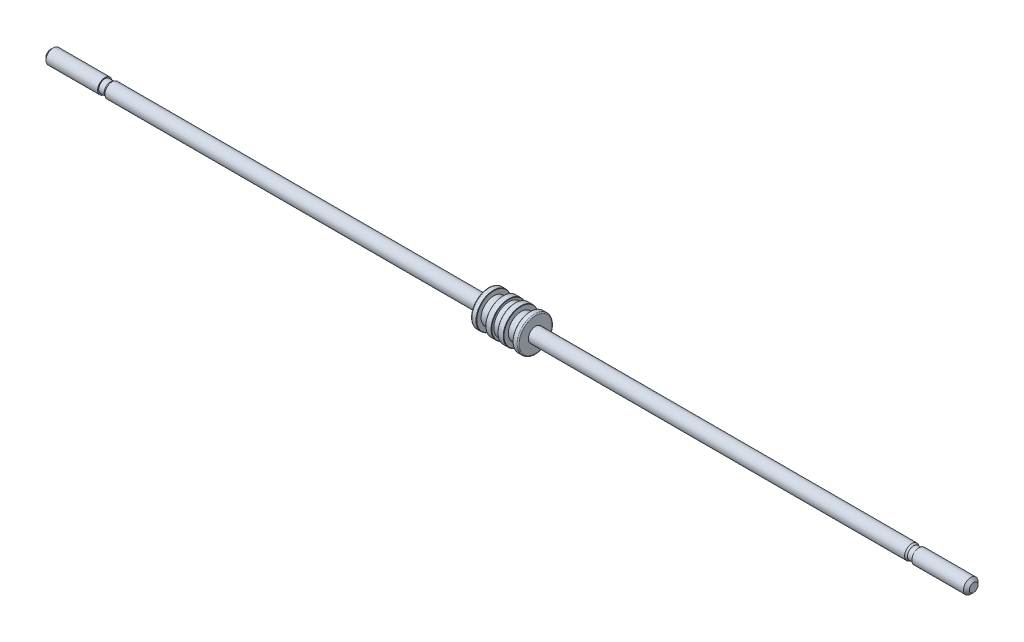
ISO-10303-21;
HEADER;
FILE_DESCRIPTION(('STEP AP214'),'2;1');
FILE_NAME('part.step','',(''),(''),'','','');
FILE_SCHEMA(('AUTOMOTIVE_DESIGN { 1 0 10303 214 1 1 1 1 }'));
ENDSEC;
DATA;
#1=APPLICATION_CONTEXT('core data for automotive mechanical design processes');
#2=APPLICATION_PROTOCOL_DEFINITION('international standard','automotive_design',2000,#1);
#3=PRODUCT_CONTEXT('',#1,'mechanical');
#4=PRODUCT('Part','Part','',(#3));
#5=PRODUCT_RELATED_PRODUCT_CATEGORY('part','',(#4));
#6=PRODUCT_DEFINITION_FORMATION('','',#4);
#7=PRODUCT_DEFINITION_CONTEXT('part definition',#1,'design');
#8=PRODUCT_DEFINITION('design','',#6,#7);
#9=PRODUCT_DEFINITION_SHAPE('','',#8);
#10=(LENGTH_UNIT() NAMED_UNIT(*) SI_UNIT(.MILLI.,.METRE.));
#11=(NAMED_UNIT(*) PLANE_ANGLE_UNIT() SI_UNIT($,.RADIAN.));
#12=(NAMED_UNIT(*) SI_UNIT($,.STERADIAN.) SOLID_ANGLE_UNIT());
#13=UNCERTAINTY_MEASURE_WITH_UNIT(LENGTH_MEASURE(1.E-05),#10,'distance_accuracy_value','');
#14=(GEOMETRIC_REPRESENTATION_CONTEXT(3) GLOBAL_UNCERTAINTY_ASSIGNED_CONTEXT((#13)) GLOBAL_UNIT_ASSIGNED_CONTEXT((#10,
#11,#12)) REPRESENTATION_CONTEXT('',''));
#15=CARTESIAN_POINT('',(0.,0.,0.));
#16=DIRECTION('',(0.,0.,1.));
#17=DIRECTION('',(1.,0.,0.));
#18=AXIS2_PLACEMENT_3D('',#15,#16,#17);
#19=CARTESIAN_POINT('',(0.,0.,0.));
#20=DIRECTION('',(1.,0.,0.));
#21=DIRECTION('',(0.,0.,-1.));
#22=AXIS2_PLACEMENT_3D('',#19,#20,#21);
#23=PLANE('',#22);
#24=CARTESIAN_POINT('',(0.,0.,0.));
#25=DIRECTION('',(1.,0.,0.));
#26=DIRECTION('',(0.,1.,0.));
#27=AXIS2_PLACEMENT_3D('',#24,#25,#26);
#28=CIRCLE('',#27,1.19999999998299);
#29=CARTESIAN_POINT('',(0.,1.19999999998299,0.));
#30=VERTEX_POINT('',#29);
#31=EDGE_CURVE('E240',#30,#30,#28,.T.);
#32=ORIENTED_EDGE('',*,*,#31,.F.);
#33=EDGE_LOOP('',(#32));
#34=FACE_BOUND('',#33,.T.);
#35=ADVANCED_FACE('F17',(#34),#23,.F.);
#36=CARTESIAN_POINT('',(0.799999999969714,0.,0.));
#37=DIRECTION('',(1.,0.,0.));
#38=DIRECTION('',(0.,1.,0.));
#39=AXIS2_PLACEMENT_3D('',#36,#37,#38);
#40=CONICAL_SURFACE('',#39,1.99999999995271,0.785398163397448);
#41=CARTESIAN_POINT('',(0.800000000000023,0.,0.));
#42=DIRECTION('',(-1.,0.,0.));
#43=DIRECTION('',(0.,0.,1.));
#44=AXIS2_PLACEMENT_3D('',#41,#42,#43);
#45=CIRCLE('',#44,2.);
#46=CARTESIAN_POINT('',(0.800000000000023,0.,2.));
#47=VERTEX_POINT('',#46);
#48=EDGE_CURVE('E239',#47,#47,#45,.F.);
#49=ORIENTED_EDGE('',*,*,#48,.F.);
#50=EDGE_LOOP('',(#49));
#51=FACE_BOUND('',#50,.T.);
#52=ORIENTED_EDGE('',*,*,#31,.T.);
#53=EDGE_LOOP('',(#52));
#54=FACE_BOUND('',#53,.T.);
#55=ADVANCED_FACE('F281',(#51,#54),#40,.T.);
#56=CARTESIAN_POINT('',(254.,0.,0.));
#57=DIRECTION('',(-1.,0.,0.));
#58=DIRECTION('',(0.,0.,1.));
#59=AXIS2_PLACEMENT_3D('',#56,#57,#58);
#60=CYLINDRICAL_SURFACE('',#59,2.);
#61=ORIENTED_EDGE('',*,*,#48,.T.);
#62=EDGE_LOOP('',(#61));
#63=FACE_BOUND('',#62,.T.);
#64=CARTESIAN_POINT('',(15.,0.,0.));
#65=DIRECTION('',(-1.,0.,0.));
#66=DIRECTION('',(0.,0.,1.));
#67=AXIS2_PLACEMENT_3D('',#64,#65,#66);
#68=CIRCLE('',#67,2.);
#69=CARTESIAN_POINT('',(15.,0.,2.));
#70=VERTEX_POINT('',#69);
#71=EDGE_CURVE('E236',#70,#70,#68,.T.);
#72=ORIENTED_EDGE('',*,*,#71,.T.);
#73=EDGE_LOOP('',(#72));
#74=FACE_BOUND('',#73,.T.);
#75=ADVANCED_FACE('F278',(#63,#74),#60,.T.);
#76=CARTESIAN_POINT('',(15.,2.,0.));
#77=DIRECTION('',(-1.,0.,0.));
#78=DIRECTION('',(0.,0.,1.));
#79=AXIS2_PLACEMENT_3D('',#76,#77,#78);
#80=PLANE('',#79);
#81=CARTESIAN_POINT('',(15.,0.,0.));
#82=DIRECTION('',(-1.,0.,0.));
#83=DIRECTION('',(0.,0.,1.));
#84=AXIS2_PLACEMENT_3D('',#81,#82,#83);
#85=CIRCLE('',#84,1.7);
#86=CARTESIAN_POINT('',(15.,0.,1.7));
#87=VERTEX_POINT('',#86);
#88=EDGE_CURVE('E232',#87,#87,#85,.F.);
#89=ORIENTED_EDGE('',*,*,#88,.F.);
#90=EDGE_LOOP('',(#89));
#91=FACE_BOUND('',#90,.T.);
#92=ORIENTED_EDGE('',*,*,#71,.F.);
#93=EDGE_LOOP('',(#92));
#94=FACE_BOUND('',#93,.T.);
#95=ADVANCED_FACE('F272',(#91,#94),#80,.F.);
#96=CARTESIAN_POINT('',(254.,0.,0.));
#97=DIRECTION('',(-1.,0.,0.));
#98=DIRECTION('',(0.,0.,1.));
#99=AXIS2_PLACEMENT_3D('',#96,#97,#98);
#100=CYLINDRICAL_SURFACE('',#99,1.7);
#101=ORIENTED_EDGE('',*,*,#88,.T.);
#102=EDGE_LOOP('',(#101));
#103=FACE_BOUND('',#102,.T.);
#104=CARTESIAN_POINT('',(16.4999999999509,0.,0.));
#105=DIRECTION('',(1.,0.,0.));
#106=DIRECTION('',(0.,0.,-1.));
#107=AXIS2_PLACEMENT_3D('',#104,#105,#106);
#108=CIRCLE('',#107,1.69999999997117);
#109=CARTESIAN_POINT('',(16.4999999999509,0.,-1.69999999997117));
#110=VERTEX_POINT('',#109);
#111=EDGE_CURVE('E235',#110,#110,#108,.T.);
#112=ORIENTED_EDGE('',*,*,#111,.F.);
#113=EDGE_LOOP('',(#112));
#114=FACE_BOUND('',#113,.T.);
#115=ADVANCED_FACE('F266',(#103,#114),#100,.T.);
#116=CARTESIAN_POINT('',(16.9999999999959,0.,0.));
#117=DIRECTION('',(1.,0.,0.));
#118=DIRECTION('',(0.,0.,-1.));
#119=AXIS2_PLACEMENT_3D('',#116,#117,#118);
#120=CONICAL_SURFACE('',#119,1.99999999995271,0.54041950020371);
#121=CARTESIAN_POINT('',(17.,0.,0.));
#122=DIRECTION('',(-1.,0.,0.));
#123=DIRECTION('',(0.,0.,1.));
#124=AXIS2_PLACEMENT_3D('',#121,#122,#123);
#125=CIRCLE('',#124,2.);
#126=CARTESIAN_POINT('',(17.,0.,2.));
#127=VERTEX_POINT('',#126);
#128=EDGE_CURVE('E68',#127,#127,#125,.F.);
#129=ORIENTED_EDGE('',*,*,#128,.F.);
#130=EDGE_LOOP('',(#129));
#131=FACE_BOUND('',#130,.T.);
#132=ORIENTED_EDGE('',*,*,#111,.T.);
#133=EDGE_LOOP('',(#132));
#134=FACE_BOUND('',#133,.T.);
#135=ADVANCED_FACE('F264',(#131,#134),#120,.T.);
#136=CARTESIAN_POINT('',(254.,0.,0.));
#137=DIRECTION('',(-1.,0.,0.));
#138=DIRECTION('',(0.,0.,1.));
#139=AXIS2_PLACEMENT_3D('',#136,#137,#138);
#140=CYLINDRICAL_SURFACE('',#139,2.);
#141=ORIENTED_EDGE('',*,*,#128,.T.);
#142=EDGE_LOOP('',(#141));
#143=FACE_BOUND('',#142,.T.);
#144=CARTESIAN_POINT('',(120.5,0.,0.));
#145=DIRECTION('',(-1.,0.,0.));
#146=DIRECTION('',(0.,0.,1.));
#147=AXIS2_PLACEMENT_3D('',#144,#145,#146);
#148=CIRCLE('',#147,2.);
#149=CARTESIAN_POINT('',(120.5,0.,2.));
#150=VERTEX_POINT('',#149);
#151=EDGE_CURVE('E53',#150,#150,#148,.T.);
#152=ORIENTED_EDGE('',*,*,#151,.T.);
#153=EDGE_LOOP('',(#152));
#154=FACE_BOUND('',#153,.T.);
#155=ADVANCED_FACE('F261',(#143,#154),#140,.T.);
#156=CARTESIAN_POINT('',(120.5,2.,0.));
#157=DIRECTION('',(1.,0.,0.));
#158=DIRECTION('',(0.,0.,-1.));
#159=AXIS2_PLACEMENT_3D('',#156,#157,#158);
#160=PLANE('',#159);
#161=CARTESIAN_POINT('',(120.5,0.,0.));
#162=DIRECTION('',(1.,0.,0.));
#163=DIRECTION('',(0.,0.,1.));
#164=AXIS2_PLACEMENT_3D('',#161,#162,#163);
#165=CIRCLE('',#164,4.5);
#166=CARTESIAN_POINT('',(120.5,0.,4.5));
#167=VERTEX_POINT('',#166);
#168=CARTESIAN_POINT('',(120.5,0.,-4.5));
#169=VERTEX_POINT('',#168);
#170=EDGE_CURVE('E45',#167,#169,#165,.T.);
#171=ORIENTED_EDGE('',*,*,#170,.F.);
#172=CARTESIAN_POINT('',(120.5,0.,0.));
#173=DIRECTION('',(1.,0.,0.));
#174=DIRECTION('',(0.,0.,-1.));
#175=AXIS2_PLACEMENT_3D('',#172,#173,#174);
#176=CIRCLE('',#175,4.5);
#177=EDGE_CURVE('E51',#169,#167,#176,.T.);
#178=ORIENTED_EDGE('',*,*,#177,.F.);
#179=EDGE_LOOP('',(#171,#178));
#180=FACE_BOUND('',#179,.T.);
#181=ORIENTED_EDGE('',*,*,#151,.F.);
#182=EDGE_LOOP('',(#181));
#183=FACE_BOUND('',#182,.T.);
#184=ADVANCED_FACE('F49',(#180,#183),#160,.F.);
#185=CARTESIAN_POINT('',(120.8,0.,0.));
#186=DIRECTION('',(-1.,0.,0.));
#187=DIRECTION('',(0.,0.,1.));
#188=AXIS2_PLACEMENT_3D('',#185,#186,#187);
#189=TOROIDAL_SURFACE('',#188,4.49999999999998,0.300000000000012);
#190=ORIENTED_EDGE('',*,*,#170,.T.);
#191=ORIENTED_EDGE('',*,*,#177,.T.);
#192=EDGE_LOOP('',(#190,#191));
#193=FACE_BOUND('',#192,.T.);
#194=CARTESIAN_POINT('',(120.8,0.,0.));
#195=DIRECTION('',(-1.,0.,0.));
#196=DIRECTION('',(0.,0.,1.));
#197=AXIS2_PLACEMENT_3D('',#194,#195,#196);
#198=CIRCLE('',#197,4.8);
#199=CARTESIAN_POINT('',(120.8,0.,4.8));
#200=VERTEX_POINT('',#199);
#201=EDGE_CURVE('E59',#200,#200,#198,.F.);
#202=ORIENTED_EDGE('',*,*,#201,.F.);
#203=EDGE_LOOP('',(#202));
#204=FACE_BOUND('',#203,.T.);
#205=ADVANCED_FACE('F57',(#193,#204),#189,.T.);
#206=CARTESIAN_POINT('',(254.,0.,0.));
#207=DIRECTION('',(-1.,0.,0.));
#208=DIRECTION('',(0.,0.,1.));
#209=AXIS2_PLACEMENT_3D('',#206,#207,#208);
#210=CYLINDRICAL_SURFACE('',#209,4.8);
#211=ORIENTED_EDGE('',*,*,#201,.T.);
#212=EDGE_LOOP('',(#211));
#213=FACE_BOUND('',#212,.T.);
#214=CARTESIAN_POINT('',(121.899999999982,0.,0.));
#215=DIRECTION('',(-1.,0.,0.));
#216=DIRECTION('',(0.,0.,1.));
#217=AXIS2_PLACEMENT_3D('',#214,#215,#216);
#218=CIRCLE('',#217,4.80000000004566);
#219=CARTESIAN_POINT('',(121.899999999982,0.,4.80000000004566));
#220=VERTEX_POINT('',#219);
#221=EDGE_CURVE('E87',#220,#220,#218,.F.);
#222=ORIENTED_EDGE('',*,*,#221,.F.);
#223=EDGE_LOOP('',(#222));
#224=FACE_BOUND('',#223,.T.);
#225=ADVANCED_FACE('F78',(#213,#224),#210,.T.);
#226=CARTESIAN_POINT('',(121.900000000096,0.,0.));
#227=DIRECTION('',(-1.,0.,0.));
#228=DIRECTION('',(0.,-1.,0.));
#229=AXIS2_PLACEMENT_3D('',#226,#227,#228);
#230=CONICAL_SURFACE('',#229,4.79999999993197,0.785398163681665);
#231=ORIENTED_EDGE('',*,*,#221,.T.);
#232=EDGE_LOOP('',(#231));
#233=FACE_BOUND('',#232,.T.);
#234=CARTESIAN_POINT('',(121.999999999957,0.,0.));
#235=DIRECTION('',(-1.,0.,0.));
#236=DIRECTION('',(0.,-1.,0.));
#237=AXIS2_PLACEMENT_3D('',#234,#235,#236);
#238=CIRCLE('',#237,4.70000000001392);
#239=CARTESIAN_POINT('',(121.999999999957,-4.70000000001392,0.));
#240=VERTEX_POINT('',#239);
#241=EDGE_CURVE('E90',#240,#240,#238,.T.);
#242=ORIENTED_EDGE('',*,*,#241,.T.);
#243=EDGE_LOOP('',(#242));
#244=FACE_BOUND('',#243,.T.);
#245=ADVANCED_FACE('F351',(#233,#244),#230,.T.);
#246=CARTESIAN_POINT('',(122.,4.7,0.));
#247=DIRECTION('',(-1.,0.,0.));
#248=DIRECTION('',(0.,0.,1.));
#249=AXIS2_PLACEMENT_3D('',#246,#247,#248);
#250=PLANE('',#249);
#251=CARTESIAN_POINT('',(122.,0.,0.));
#252=DIRECTION('',(-1.,0.,0.));
#253=DIRECTION('',(0.,0.,1.));
#254=AXIS2_PLACEMENT_3D('',#251,#252,#253);
#255=CIRCLE('',#254,3.5);
#256=CARTESIAN_POINT('',(122.,0.,3.5));
#257=VERTEX_POINT('',#256);
#258=EDGE_CURVE('E225',#257,#257,#255,.F.);
#259=ORIENTED_EDGE('',*,*,#258,.F.);
#260=EDGE_LOOP('',(#259));
#261=FACE_BOUND('',#260,.T.);
#262=ORIENTED_EDGE('',*,*,#241,.F.);
#263=EDGE_LOOP('',(#262));
#264=FACE_BOUND('',#263,.T.);
#265=ADVANCED_FACE('F360',(#261,#264),#250,.F.);
#266=CARTESIAN_POINT('',(254.,0.,0.));
#267=DIRECTION('',(-1.,0.,0.));
#268=DIRECTION('',(0.,0.,1.));
#269=AXIS2_PLACEMENT_3D('',#266,#267,#268);
#270=CYLINDRICAL_SURFACE('',#269,3.5);
#271=ORIENTED_EDGE('',*,*,#258,.T.);
#272=EDGE_LOOP('',(#271));
#273=FACE_BOUND('',#272,.T.);
#274=CARTESIAN_POINT('',(124.5,0.,0.));
#275=DIRECTION('',(-1.,0.,0.));
#276=DIRECTION('',(0.,0.,1.));
#277=AXIS2_PLACEMENT_3D('',#274,#275,#276);
#278=CIRCLE('',#277,3.5);
#279=CARTESIAN_POINT('',(124.5,0.,3.5));
#280=VERTEX_POINT('',#279);
#281=EDGE_CURVE('E222',#280,#280,#278,.T.);
#282=ORIENTED_EDGE('',*,*,#281,.T.);
#283=EDGE_LOOP('',(#282));
#284=FACE_BOUND('',#283,.T.);
#285=ADVANCED_FACE('F369',(#273,#284),#270,.T.);
#286=CARTESIAN_POINT('',(124.5,3.5,0.));
#287=DIRECTION('',(1.,0.,0.));
#288=DIRECTION('',(0.,0.,-1.));
#289=AXIS2_PLACEMENT_3D('',#286,#287,#288);
#290=PLANE('',#289);
#291=CARTESIAN_POINT('',(124.499999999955,0.,0.));
#292=DIRECTION('',(1.,0.,0.));
#293=DIRECTION('',(0.,0.,-1.));
#294=AXIS2_PLACEMENT_3D('',#291,#292,#293);
#295=CIRCLE('',#294,4.69999999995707);
#296=CARTESIAN_POINT('',(124.499999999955,0.,-4.69999999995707));
#297=VERTEX_POINT('',#296);
#298=EDGE_CURVE('E95',#297,#297,#295,.T.);
#299=ORIENTED_EDGE('',*,*,#298,.F.);
#300=EDGE_LOOP('',(#299));
#301=FACE_BOUND('',#300,.T.);
#302=ORIENTED_EDGE('',*,*,#281,.F.);
#303=EDGE_LOOP('',(#302));
#304=FACE_BOUND('',#303,.T.);
#305=ADVANCED_FACE('F379',(#301,#304),#290,.F.);
#306=CARTESIAN_POINT('',(124.599999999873,0.,0.));
#307=DIRECTION('',(1.,0.,0.));
#308=DIRECTION('',(0.,0.,-1.));
#309=AXIS2_PLACEMENT_3D('',#306,#307,#308);
#310=CONICAL_SURFACE('',#309,4.79999999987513,0.785398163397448);
#311=CARTESIAN_POINT('',(124.6,0.,0.));
#312=DIRECTION('',(-1.,0.,0.));
#313=DIRECTION('',(0.,0.,1.));
#314=AXIS2_PLACEMENT_3D('',#311,#312,#313);
#315=CIRCLE('',#314,4.8);
#316=CARTESIAN_POINT('',(124.6,0.,4.8));
#317=VERTEX_POINT('',#316);
#318=EDGE_CURVE('E91',#317,#317,#315,.F.);
#319=ORIENTED_EDGE('',*,*,#318,.F.);
#320=EDGE_LOOP('',(#319));
#321=FACE_BOUND('',#320,.T.);
#322=ORIENTED_EDGE('',*,*,#298,.T.);
#323=EDGE_LOOP('',(#322));
#324=FACE_BOUND('',#323,.T.);
#325=ADVANCED_FACE('F389',(#321,#324),#310,.T.);
#326=CARTESIAN_POINT('',(254.,0.,0.));
#327=DIRECTION('',(-1.,0.,0.));
#328=DIRECTION('',(0.,0.,1.));
#329=AXIS2_PLACEMENT_3D('',#326,#327,#328);
#330=CYLINDRICAL_SURFACE('',#329,4.8);
#331=ORIENTED_EDGE('',*,*,#318,.T.);
#332=EDGE_LOOP('',(#331));
#333=FACE_BOUND('',#332,.T.);
#334=CARTESIAN_POINT('',(126.049999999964,0.,0.));
#335=DIRECTION('',(-1.,0.,0.));
#336=DIRECTION('',(0.,0.,1.));
#337=AXIS2_PLACEMENT_3D('',#334,#335,#336);
#338=CIRCLE('',#337,4.80000000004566);
#339=CARTESIAN_POINT('',(126.049999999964,0.,4.80000000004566));
#340=VERTEX_POINT('',#339);
#341=EDGE_CURVE('E94',#340,#340,#338,.F.);
#342=ORIENTED_EDGE('',*,*,#341,.F.);
#343=EDGE_LOOP('',(#342));
#344=FACE_BOUND('',#343,.T.);
#345=ADVANCED_FACE('F399',(#333,#344),#330,.T.);
#346=CARTESIAN_POINT('',(126.050000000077,0.,0.));
#347=DIRECTION('',(-1.,0.,0.));
#348=DIRECTION('',(0.,0.,1.));
#349=AXIS2_PLACEMENT_3D('',#346,#347,#348);
#350=CONICAL_SURFACE('',#349,4.79999999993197,0.785398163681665);
#351=ORIENTED_EDGE('',*,*,#341,.T.);
#352=EDGE_LOOP('',(#351));
#353=FACE_BOUND('',#352,.T.);
#354=CARTESIAN_POINT('',(126.149999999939,0.,0.));
#355=DIRECTION('',(-1.,0.,0.));
#356=DIRECTION('',(0.,0.,1.));
#357=AXIS2_PLACEMENT_3D('',#354,#355,#356);
#358=CIRCLE('',#357,4.70000000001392);
#359=CARTESIAN_POINT('',(126.149999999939,0.,4.70000000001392));
#360=VERTEX_POINT('',#359);
#361=EDGE_CURVE('E98',#360,#360,#358,.T.);
#362=ORIENTED_EDGE('',*,*,#361,.T.);
#363=EDGE_LOOP('',(#362));
#364=FACE_BOUND('',#363,.T.);
#365=ADVANCED_FACE('F409',(#353,#364),#350,.T.);
#366=CARTESIAN_POINT('',(126.15,4.7,0.));
#367=DIRECTION('',(-1.,0.,0.));
#368=DIRECTION('',(0.,0.,1.));
#369=AXIS2_PLACEMENT_3D('',#366,#367,#368);
#370=PLANE('',#369);
#371=CARTESIAN_POINT('',(126.15,0.,0.));
#372=DIRECTION('',(-1.,0.,0.));
#373=DIRECTION('',(0.,0.,1.));
#374=AXIS2_PLACEMENT_3D('',#371,#372,#373);
#375=CIRCLE('',#374,4.15);
#376=CARTESIAN_POINT('',(126.15,0.,4.15));
#377=VERTEX_POINT('',#376);
#378=EDGE_CURVE('E215',#377,#377,#375,.F.);
#379=ORIENTED_EDGE('',*,*,#378,.F.);
#380=EDGE_LOOP('',(#379));
#381=FACE_BOUND('',#380,.T.);
#382=ORIENTED_EDGE('',*,*,#361,.F.);
#383=EDGE_LOOP('',(#382));
#384=FACE_BOUND('',#383,.T.);
#385=ADVANCED_FACE('F419',(#381,#384),#370,.F.);
#386=CARTESIAN_POINT('',(254.,0.,0.));
#387=DIRECTION('',(-1.,0.,0.));
#388=DIRECTION('',(0.,0.,1.));
#389=AXIS2_PLACEMENT_3D('',#386,#387,#388);
#390=CYLINDRICAL_SURFACE('',#389,4.15);
#391=ORIENTED_EDGE('',*,*,#378,.T.);
#392=EDGE_LOOP('',(#391));
#393=FACE_BOUND('',#392,.T.);
#394=CARTESIAN_POINT('',(127.85,0.,0.));
#395=DIRECTION('',(-1.,0.,0.));
#396=DIRECTION('',(0.,0.,1.));
#397=AXIS2_PLACEMENT_3D('',#394,#395,#396);
#398=CIRCLE('',#397,4.15);
#399=CARTESIAN_POINT('',(127.85,0.,4.15));
#400=VERTEX_POINT('',#399);
#401=EDGE_CURVE('E212',#400,#400,#398,.T.);
#402=ORIENTED_EDGE('',*,*,#401,.T.);
#403=EDGE_LOOP('',(#402));
#404=FACE_BOUND('',#403,.T.);
#405=ADVANCED_FACE('F429',(#393,#404),#390,.T.);
#406=CARTESIAN_POINT('',(127.85,4.15,0.));
#407=DIRECTION('',(1.,0.,0.));
#408=DIRECTION('',(0.,0.,-1.));
#409=AXIS2_PLACEMENT_3D('',#406,#407,#408);
#410=PLANE('',#409);
#411=CARTESIAN_POINT('',(127.849999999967,0.,0.));
#412=DIRECTION('',(1.,0.,0.));
#413=DIRECTION('',(0.,0.,-1.));
#414=AXIS2_PLACEMENT_3D('',#411,#412,#413);
#415=CIRCLE('',#414,4.69999999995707);
#416=CARTESIAN_POINT('',(127.849999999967,0.,-4.69999999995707));
#417=VERTEX_POINT('',#416);
#418=EDGE_CURVE('E103',#417,#417,#415,.T.);
#419=ORIENTED_EDGE('',*,*,#418,.F.);
#420=EDGE_LOOP('',(#419));
#421=FACE_BOUND('',#420,.T.);
#422=ORIENTED_EDGE('',*,*,#401,.F.);
#423=EDGE_LOOP('',(#422));
#424=FACE_BOUND('',#423,.T.);
#425=ADVANCED_FACE('F439',(#421,#424),#410,.F.);
#426=CARTESIAN_POINT('',(127.949999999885,0.,0.));
#427=DIRECTION('',(1.,0.,0.));
#428=DIRECTION('',(0.,0.,-1.));
#429=AXIS2_PLACEMENT_3D('',#426,#427,#428);
#430=CONICAL_SURFACE('',#429,4.79999999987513,0.785398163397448);
#431=CARTESIAN_POINT('',(127.95,0.,0.));
#432=DIRECTION('',(-1.,0.,0.));
#433=DIRECTION('',(0.,0.,1.));
#434=AXIS2_PLACEMENT_3D('',#431,#432,#433);
#435=CIRCLE('',#434,4.8);
#436=CARTESIAN_POINT('',(127.95,0.,4.8));
#437=VERTEX_POINT('',#436);
#438=EDGE_CURVE('E99',#437,#437,#435,.F.);
#439=ORIENTED_EDGE('',*,*,#438,.F.);
#440=EDGE_LOOP('',(#439));
#441=FACE_BOUND('',#440,.T.);
#442=ORIENTED_EDGE('',*,*,#418,.T.);
#443=EDGE_LOOP('',(#442));
#444=FACE_BOUND('',#443,.T.);
#445=ADVANCED_FACE('F449',(#441,#444),#430,.T.);
#446=CARTESIAN_POINT('',(254.,0.,0.));
#447=DIRECTION('',(-1.,0.,0.));
#448=DIRECTION('',(0.,0.,1.));
#449=AXIS2_PLACEMENT_3D('',#446,#447,#448);
#450=CYLINDRICAL_SURFACE('',#449,4.8);
#451=ORIENTED_EDGE('',*,*,#438,.T.);
#452=EDGE_LOOP('',(#451));
#453=FACE_BOUND('',#452,.T.);
#454=CARTESIAN_POINT('',(129.399999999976,0.,0.));
#455=DIRECTION('',(-1.,0.,0.));
#456=DIRECTION('',(0.,0.,1.));
#457=AXIS2_PLACEMENT_3D('',#454,#455,#456);
#458=CIRCLE('',#457,4.80000000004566);
#459=CARTESIAN_POINT('',(129.399999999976,0.,4.80000000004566));
#460=VERTEX_POINT('',#459);
#461=EDGE_CURVE('E102',#460,#460,#458,.F.);
#462=ORIENTED_EDGE('',*,*,#461,.F.);
#463=EDGE_LOOP('',(#462));
#464=FACE_BOUND('',#463,.T.);
#465=ADVANCED_FACE('F459',(#453,#464),#450,.T.);
#466=CARTESIAN_POINT('',(129.400000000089,0.,0.));
#467=DIRECTION('',(-1.,0.,0.));
#468=DIRECTION('',(0.,0.,1.));
#469=AXIS2_PLACEMENT_3D('',#466,#467,#468);
#470=CONICAL_SURFACE('',#469,4.79999999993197,0.785398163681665);
#471=ORIENTED_EDGE('',*,*,#461,.T.);
#472=EDGE_LOOP('',(#471));
#473=FACE_BOUND('',#472,.T.);
#474=CARTESIAN_POINT('',(129.49999999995,0.,0.));
#475=DIRECTION('',(-1.,0.,0.));
#476=DIRECTION('',(0.,0.,1.));
#477=AXIS2_PLACEMENT_3D('',#474,#475,#476);
#478=CIRCLE('',#477,4.70000000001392);
#479=CARTESIAN_POINT('',(129.49999999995,0.,4.70000000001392));
#480=VERTEX_POINT('',#479);
#481=EDGE_CURVE('E106',#480,#480,#478,.T.);
#482=ORIENTED_EDGE('',*,*,#481,.T.);
#483=EDGE_LOOP('',(#482));
#484=FACE_BOUND('',#483,.T.);
#485=ADVANCED_FACE('F469',(#473,#484),#470,.T.);
#486=CARTESIAN_POINT('',(129.5,4.7,0.));
#487=DIRECTION('',(-1.,0.,0.));
#488=DIRECTION('',(0.,0.,1.));
#489=AXIS2_PLACEMENT_3D('',#486,#487,#488);
#490=PLANE('',#489);
#491=CARTESIAN_POINT('',(129.5,0.,0.));
#492=DIRECTION('',(-1.,0.,0.));
#493=DIRECTION('',(0.,0.,1.));
#494=AXIS2_PLACEMENT_3D('',#491,#492,#493);
#495=CIRCLE('',#494,3.5);
#496=CARTESIAN_POINT('',(129.5,0.,3.5));
#497=VERTEX_POINT('',#496);
#498=EDGE_CURVE('E205',#497,#497,#495,.F.);
#499=ORIENTED_EDGE('',*,*,#498,.F.);
#500=EDGE_LOOP('',(#499));
#501=FACE_BOUND('',#500,.T.);
#502=ORIENTED_EDGE('',*,*,#481,.F.);
#503=EDGE_LOOP('',(#502));
#504=FACE_BOUND('',#503,.T.);
#505=ADVANCED_FACE('F479',(#501,#504),#490,.F.);
#506=CARTESIAN_POINT('',(254.,1.2,0.));
#507=DIRECTION('',(-1.,0.,0.));
#508=DIRECTION('',(0.,0.,1.));
#509=AXIS2_PLACEMENT_3D('',#506,#507,#508);
#510=PLANE('',#509);
#511=CARTESIAN_POINT('',(254.000000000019,0.,0.));
#512=DIRECTION('',(-1.,0.,0.));
#513=DIRECTION('',(0.,0.,1.));
#514=AXIS2_PLACEMENT_3D('',#511,#512,#513);
#515=CIRCLE('',#514,1.19999999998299);
#516=CARTESIAN_POINT('',(254.000000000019,0.,1.19999999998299));
#517=VERTEX_POINT('',#516);
#518=EDGE_CURVE('E202',#517,#517,#515,.T.);
#519=ORIENTED_EDGE('',*,*,#518,.F.);
#520=EDGE_LOOP('',(#519));
#521=FACE_BOUND('',#520,.T.);
#522=ADVANCED_FACE('F489',(#521),#510,.F.);
#523=CARTESIAN_POINT('',(254.,0.,0.));
#524=DIRECTION('',(-1.,0.,0.));
#525=DIRECTION('',(0.,0.,1.));
#526=AXIS2_PLACEMENT_3D('',#523,#524,#525);
#527=CYLINDRICAL_SURFACE('',#526,3.5);
#528=ORIENTED_EDGE('',*,*,#498,.T.);
#529=EDGE_LOOP('',(#528));
#530=FACE_BOUND('',#529,.T.);
#531=CARTESIAN_POINT('',(132.,0.,0.));
#532=DIRECTION('',(-1.,0.,0.));
#533=DIRECTION('',(0.,0.,1.));
#534=AXIS2_PLACEMENT_3D('',#531,#532,#533);
#535=CIRCLE('',#534,3.5);
#536=CARTESIAN_POINT('',(132.,0.,3.5));
#537=VERTEX_POINT('',#536);
#538=EDGE_CURVE('E111',#537,#537,#535,.T.);
#539=ORIENTED_EDGE('',*,*,#538,.T.);
#540=EDGE_LOOP('',(#539));
#541=FACE_BOUND('',#540,.T.);
#542=ADVANCED_FACE('F499',(#530,#541),#527,.T.);
#543=CARTESIAN_POINT('',(253.199999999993,0.,0.));
#544=DIRECTION('',(-1.,0.,0.));
#545=DIRECTION('',(0.,0.,1.));
#546=AXIS2_PLACEMENT_3D('',#543,#544,#545);
#547=CONICAL_SURFACE('',#546,2.00000000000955,0.785398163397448);
#548=CARTESIAN_POINT('',(253.2,0.,0.));
#549=DIRECTION('',(-1.,0.,0.));
#550=DIRECTION('',(0.,0.,1.));
#551=AXIS2_PLACEMENT_3D('',#548,#549,#550);
#552=CIRCLE('',#551,2.);
#553=CARTESIAN_POINT('',(253.2,0.,2.));
#554=VERTEX_POINT('',#553);
#555=EDGE_CURVE('E107',#554,#554,#552,.T.);
#556=ORIENTED_EDGE('',*,*,#555,.F.);
#557=EDGE_LOOP('',(#556));
#558=FACE_BOUND('',#557,.T.);
#559=ORIENTED_EDGE('',*,*,#518,.T.);
#560=EDGE_LOOP('',(#559));
#561=FACE_BOUND('',#560,.T.);
#562=ADVANCED_FACE('F509',(#558,#561),#547,.T.);
#563=CARTESIAN_POINT('',(132.,3.5,0.));
#564=DIRECTION('',(1.,0.,0.));
#565=DIRECTION('',(0.,0.,-1.));
#566=AXIS2_PLACEMENT_3D('',#563,#564,#565);
#567=PLANE('',#566);
#568=CARTESIAN_POINT('',(131.999999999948,0.,0.));
#569=DIRECTION('',(1.,0.,0.));
#570=DIRECTION('',(0.,0.,-1.));
#571=AXIS2_PLACEMENT_3D('',#568,#569,#570);
#572=CIRCLE('',#571,4.69999999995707);
#573=CARTESIAN_POINT('',(131.999999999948,0.,-4.69999999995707));
#574=VERTEX_POINT('',#573);
#575=EDGE_CURVE('E110',#574,#574,#572,.T.);
#576=ORIENTED_EDGE('',*,*,#575,.F.);
#577=EDGE_LOOP('',(#576));
#578=FACE_BOUND('',#577,.T.);
#579=ORIENTED_EDGE('',*,*,#538,.F.);
#580=EDGE_LOOP('',(#579));
#581=FACE_BOUND('',#580,.T.);
#582=ADVANCED_FACE('F519',(#578,#581),#567,.F.);
#583=CARTESIAN_POINT('',(254.,0.,0.));
#584=DIRECTION('',(-1.,0.,0.));
#585=DIRECTION('',(0.,0.,1.));
#586=AXIS2_PLACEMENT_3D('',#583,#584,#585);
#587=CYLINDRICAL_SURFACE('',#586,2.);
#588=CARTESIAN_POINT('',(239.,0.,0.));
#589=DIRECTION('',(-1.,0.,0.));
#590=DIRECTION('',(0.,0.,1.));
#591=AXIS2_PLACEMENT_3D('',#588,#589,#590);
#592=CIRCLE('',#591,2.);
#593=CARTESIAN_POINT('',(239.,0.,2.));
#594=VERTEX_POINT('',#593);
#595=EDGE_CURVE('E116',#594,#594,#592,.F.);
#596=ORIENTED_EDGE('',*,*,#595,.T.);
#597=EDGE_LOOP('',(#596));
#598=FACE_BOUND('',#597,.T.);
#599=ORIENTED_EDGE('',*,*,#555,.T.);
#600=EDGE_LOOP('',(#599));
#601=FACE_BOUND('',#600,.T.);
#602=ADVANCED_FACE('F529',(#598,#601),#587,.T.);
#603=CARTESIAN_POINT('',(132.099999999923,0.,0.));
#604=DIRECTION('',(1.,0.,0.));
#605=DIRECTION('',(0.,0.,-1.));
#606=AXIS2_PLACEMENT_3D('',#603,#604,#605);
#607=CONICAL_SURFACE('',#606,4.79999999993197,0.785398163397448);
#608=CARTESIAN_POINT('',(132.1,0.,0.));
#609=DIRECTION('',(-1.,0.,0.));
#610=DIRECTION('',(0.,0.,1.));
#611=AXIS2_PLACEMENT_3D('',#608,#609,#610);
#612=CIRCLE('',#611,4.8);
#613=CARTESIAN_POINT('',(132.1,0.,4.8));
#614=VERTEX_POINT('',#613);
#615=EDGE_CURVE('E112',#614,#614,#612,.F.);
#616=ORIENTED_EDGE('',*,*,#615,.F.);
#617=EDGE_LOOP('',(#616));
#618=FACE_BOUND('',#617,.T.);
#619=ORIENTED_EDGE('',*,*,#575,.T.);
#620=EDGE_LOOP('',(#619));
#621=FACE_BOUND('',#620,.T.);
#622=ADVANCED_FACE('F539',(#618,#621),#607,.T.);
#623=CARTESIAN_POINT('',(239.,1.7,0.));
#624=DIRECTION('',(1.,0.,0.));
#625=DIRECTION('',(0.,0.,-1.));
#626=AXIS2_PLACEMENT_3D('',#623,#624,#625);
#627=PLANE('',#626);
#628=ORIENTED_EDGE('',*,*,#595,.F.);
#629=EDGE_LOOP('',(#628));
#630=FACE_BOUND('',#629,.T.);
#631=CARTESIAN_POINT('',(239.,0.,0.));
#632=DIRECTION('',(-1.,0.,0.));
#633=DIRECTION('',(0.,0.,1.));
#634=AXIS2_PLACEMENT_3D('',#631,#632,#633);
#635=CIRCLE('',#634,1.7);
#636=CARTESIAN_POINT('',(239.,0.,1.7));
#637=VERTEX_POINT('',#636);
#638=EDGE_CURVE('E115',#637,#637,#635,.T.);
#639=ORIENTED_EDGE('',*,*,#638,.F.);
#640=EDGE_LOOP('',(#639));
#641=FACE_BOUND('',#640,.T.);
#642=ADVANCED_FACE('F549',(#630,#641),#627,.F.);
#643=CARTESIAN_POINT('',(254.,0.,0.));
#644=DIRECTION('',(-1.,0.,0.));
#645=DIRECTION('',(0.,0.,1.));
#646=AXIS2_PLACEMENT_3D('',#643,#644,#645);
#647=CYLINDRICAL_SURFACE('',#646,4.8);
#648=ORIENTED_EDGE('',*,*,#615,.T.);
#649=EDGE_LOOP('',(#648));
#650=FACE_BOUND('',#649,.T.);
#651=CARTESIAN_POINT('',(133.2,0.,0.));
#652=DIRECTION('',(-1.,0.,0.));
#653=DIRECTION('',(0.,0.,1.));
#654=AXIS2_PLACEMENT_3D('',#651,#652,#653);
#655=CIRCLE('',#654,4.8);
#656=CARTESIAN_POINT('',(133.2,0.,4.8));
#657=VERTEX_POINT('',#656);
#658=EDGE_CURVE('E117',#657,#657,#655,.F.);
#659=ORIENTED_EDGE('',*,*,#658,.F.);
#660=EDGE_LOOP('',(#659));
#661=FACE_BOUND('',#660,.T.);
#662=ADVANCED_FACE('F189',(#650,#661),#647,.T.);
#663=CARTESIAN_POINT('',(254.,0.,0.));
#664=DIRECTION('',(-1.,0.,0.));
#665=DIRECTION('',(0.,0.,1.));
#666=AXIS2_PLACEMENT_3D('',#663,#664,#665);
#667=CYLINDRICAL_SURFACE('',#666,1.7);
#668=CARTESIAN_POINT('',(237.500000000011,0.,0.));
#669=DIRECTION('',(-1.,0.,0.));
#670=DIRECTION('',(0.,0.,1.));
#671=AXIS2_PLACEMENT_3D('',#668,#669,#670);
#672=CIRCLE('',#671,1.70000000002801);
#673=CARTESIAN_POINT('',(237.500000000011,0.,1.70000000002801));
#674=VERTEX_POINT('',#673);
#675=EDGE_CURVE('E120',#674,#674,#672,.T.);
#676=ORIENTED_EDGE('',*,*,#675,.F.);
#677=EDGE_LOOP('',(#676));
#678=FACE_BOUND('',#677,.T.);
#679=ORIENTED_EDGE('',*,*,#638,.T.);
#680=EDGE_LOOP('',(#679));
#681=FACE_BOUND('',#680,.T.);
#682=ADVANCED_FACE('F139',(#678,#681),#667,.T.);
#683=CARTESIAN_POINT('',(133.2,0.,0.));
#684=DIRECTION('',(-1.,0.,0.));
#685=DIRECTION('',(0.,0.,1.));
#686=AXIS2_PLACEMENT_3D('',#683,#684,#685);
#687=TOROIDAL_SURFACE('',#686,4.49999999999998,0.300000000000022);
#688=ORIENTED_EDGE('',*,*,#658,.T.);
#689=EDGE_LOOP('',(#688));
#690=FACE_BOUND('',#689,.T.);
#691=CARTESIAN_POINT('',(133.5,0.,0.));
#692=DIRECTION('',(-1.,0.,0.));
#693=DIRECTION('',(0.,0.,1.));
#694=AXIS2_PLACEMENT_3D('',#691,#692,#693);
#695=CIRCLE('',#694,4.49999999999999);
#696=CARTESIAN_POINT('',(133.5,0.,4.49999999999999));
#697=VERTEX_POINT('',#696);
#698=CARTESIAN_POINT('',(133.5,0.,-4.49999999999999));
#699=VERTEX_POINT('',#698);
#700=EDGE_CURVE('E148',#697,#699,#695,.T.);
#701=ORIENTED_EDGE('',*,*,#700,.T.);
#702=CARTESIAN_POINT('',(133.5,0.,0.));
#703=DIRECTION('',(-1.,0.,0.));
#704=DIRECTION('',(0.,0.,-1.));
#705=AXIS2_PLACEMENT_3D('',#702,#703,#704);
#706=CIRCLE('',#705,4.49999999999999);
#707=EDGE_CURVE('E36',#699,#697,#706,.T.);
#708=ORIENTED_EDGE('',*,*,#707,.T.);
#709=EDGE_LOOP('',(#701,#708));
#710=FACE_BOUND('',#709,.T.);
#711=ADVANCED_FACE('F128',(#690,#710),#687,.T.);
#712=CARTESIAN_POINT('',(237.000000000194,0.,0.));
#713=DIRECTION('',(-1.,0.,0.));
#714=DIRECTION('',(0.,0.,1.));
#715=AXIS2_PLACEMENT_3D('',#712,#713,#714);
#716=CONICAL_SURFACE('',#715,1.99999999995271,0.540419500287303);
#717=CARTESIAN_POINT('',(237.,0.,0.));
#718=DIRECTION('',(-1.,0.,0.));
#719=DIRECTION('',(0.,0.,1.));
#720=AXIS2_PLACEMENT_3D('',#717,#718,#719);
#721=CIRCLE('',#720,2.);
#722=CARTESIAN_POINT('',(237.,0.,2.));
#723=VERTEX_POINT('',#722);
#724=EDGE_CURVE('E28',#723,#723,#721,.T.);
#725=ORIENTED_EDGE('',*,*,#724,.F.);
#726=EDGE_LOOP('',(#725));
#727=FACE_BOUND('',#726,.T.);
#728=ORIENTED_EDGE('',*,*,#675,.T.);
#729=EDGE_LOOP('',(#728));
#730=FACE_BOUND('',#729,.T.);
#731=ADVANCED_FACE('F138',(#727,#730),#716,.T.);
#732=CARTESIAN_POINT('',(133.5,4.5,0.));
#733=DIRECTION('',(-1.,0.,0.));
#734=DIRECTION('',(0.,0.,1.));
#735=AXIS2_PLACEMENT_3D('',#732,#733,#734);
#736=PLANE('',#735);
#737=CARTESIAN_POINT('',(133.5,0.,0.));
#738=DIRECTION('',(-1.,0.,0.));
#739=DIRECTION('',(0.,0.,1.));
#740=AXIS2_PLACEMENT_3D('',#737,#738,#739);
#741=CIRCLE('',#740,2.);
#742=CARTESIAN_POINT('',(133.5,0.,2.));
#743=VERTEX_POINT('',#742);
#744=EDGE_CURVE('E11',#743,#743,#741,.F.);
#745=ORIENTED_EDGE('',*,*,#744,.F.);
#746=EDGE_LOOP('',(#745));
#747=FACE_BOUND('',#746,.T.);
#748=ORIENTED_EDGE('',*,*,#707,.F.);
#749=ORIENTED_EDGE('',*,*,#700,.F.);
#750=EDGE_LOOP('',(#748,#749));
#751=FACE_BOUND('',#750,.T.);
#752=ADVANCED_FACE('F153',(#747,#751),#736,.F.);
#753=CARTESIAN_POINT('',(254.,0.,0.));
#754=DIRECTION('',(-1.,0.,0.));
#755=DIRECTION('',(0.,0.,1.));
#756=AXIS2_PLACEMENT_3D('',#753,#754,#755);
#757=CYLINDRICAL_SURFACE('',#756,2.);
#758=ORIENTED_EDGE('',*,*,#744,.T.);
#759=EDGE_LOOP('',(#758));
#760=FACE_BOUND('',#759,.T.);
#761=ORIENTED_EDGE('',*,*,#724,.T.);
#762=EDGE_LOOP('',(#761));
#763=FACE_BOUND('',#762,.T.);
#764=ADVANCED_FACE('F162',(#760,#763),#757,.T.);
#765=CLOSED_SHELL('',(#35,#55,#75,#95,#115,#135,#155,#184,#205,#225,#245,#265,#285,#305,#325,
#345,#365,#385,#405,#425,#445,#465,#485,#505,#522,#542,#562,#582,#602,#622,#642,#662,#682,#711,
#731,#752,#764));
#766=MANIFOLD_SOLID_BREP('B1',#765);
#767=ADVANCED_BREP_SHAPE_REPRESENTATION('',(#18,#766),#14);
#768=SHAPE_DEFINITION_REPRESENTATION(#9,#767);
ENDSEC;
END-ISO-10303-21;
